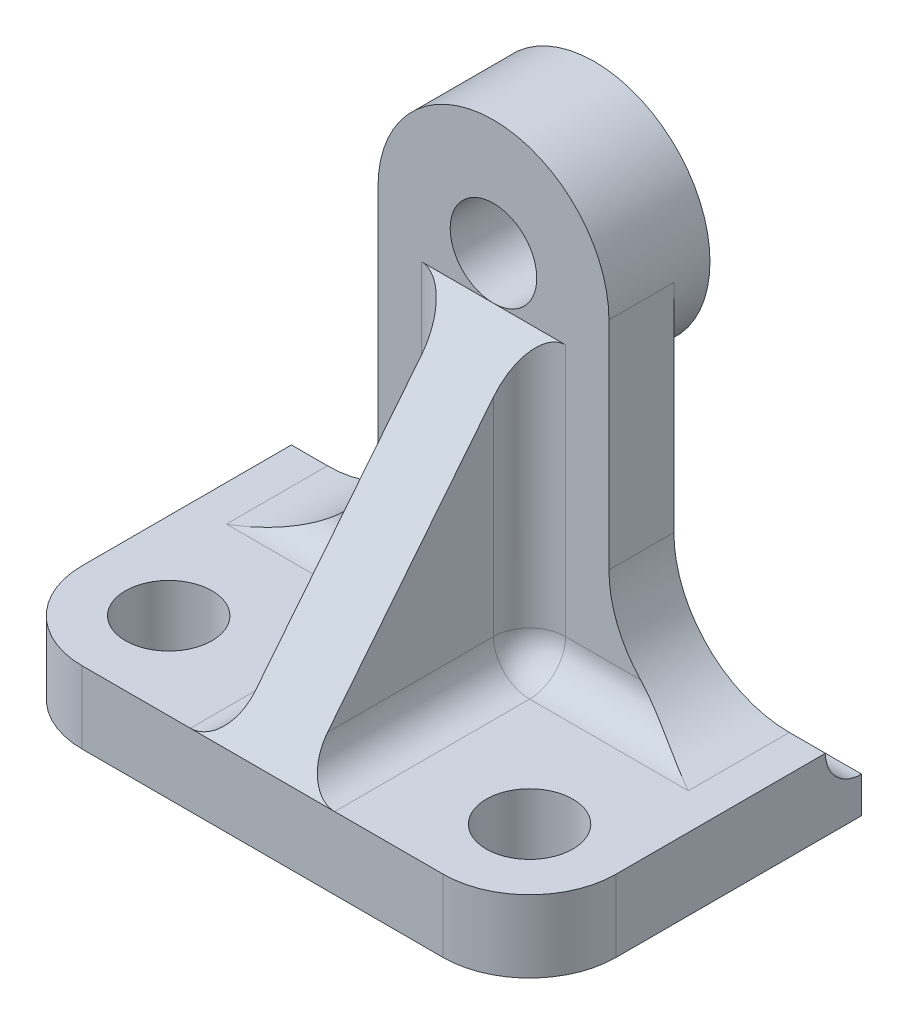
ISO-10303-21;
HEADER;
FILE_DESCRIPTION(('STEP AP214'),'2;1');
FILE_NAME('part.step','',(''),(''),'','','');
FILE_SCHEMA(('AUTOMOTIVE_DESIGN { 1 0 10303 214 1 1 1 1 }'));
ENDSEC;
DATA;
#1=APPLICATION_CONTEXT('core data for automotive mechanical design processes');
#2=APPLICATION_PROTOCOL_DEFINITION('international standard','automotive_design',2000,#1);
#3=PRODUCT_CONTEXT('',#1,'mechanical');
#4=PRODUCT('Part','Part','',(#3));
#5=PRODUCT_RELATED_PRODUCT_CATEGORY('part','',(#4));
#6=PRODUCT_DEFINITION_FORMATION('','',#4);
#7=PRODUCT_DEFINITION_CONTEXT('part definition',#1,'design');
#8=PRODUCT_DEFINITION('design','',#6,#7);
#9=PRODUCT_DEFINITION_SHAPE('','',#8);
#10=(LENGTH_UNIT() NAMED_UNIT(*) SI_UNIT(.MILLI.,.METRE.));
#11=(NAMED_UNIT(*) PLANE_ANGLE_UNIT() SI_UNIT($,.RADIAN.));
#12=(NAMED_UNIT(*) SI_UNIT($,.STERADIAN.) SOLID_ANGLE_UNIT());
#13=UNCERTAINTY_MEASURE_WITH_UNIT(LENGTH_MEASURE(1.E-05),#10,'distance_accuracy_value','');
#14=(GEOMETRIC_REPRESENTATION_CONTEXT(3) GLOBAL_UNCERTAINTY_ASSIGNED_CONTEXT((#13)) GLOBAL_UNIT_ASSIGNED_CONTEXT((#10,
#11,#12)) REPRESENTATION_CONTEXT('',''));
#15=CARTESIAN_POINT('',(0.,0.,0.));
#16=DIRECTION('',(0.,0.,1.));
#17=DIRECTION('',(1.,0.,0.));
#18=AXIS2_PLACEMENT_3D('',#15,#16,#17);
#19=CARTESIAN_POINT('',(-32.7821930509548,0.,46.));
#20=DIRECTION('',(0.,1.,0.));
#21=DIRECTION('',(0.,0.,1.));
#22=AXIS2_PLACEMENT_3D('',#19,#20,#21);
#23=PLANE('',#22);
#24=CARTESIAN_POINT('',(29.217806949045,0.,34.0000000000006));
#25=DIRECTION('',(0.,1.,0.));
#26=DIRECTION('',(0.,0.,1.));
#27=AXIS2_PLACEMENT_3D('',#24,#25,#26);
#28=CIRCLE('',#27,5.99999999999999);
#29=CARTESIAN_POINT('',(29.217806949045,0.,40.0000000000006));
#30=VERTEX_POINT('',#29);
#31=EDGE_CURVE('E401',#30,#30,#28,.T.);
#32=ORIENTED_EDGE('',*,*,#31,.F.);
#33=EDGE_LOOP('',(#32));
#34=FACE_BOUND('',#33,.T.);
#35=DIRECTION('',(1.,0.,0.));
#36=VECTOR('',#35,1.);
#37=CARTESIAN_POINT('',(-32.7821930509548,0.,19.));
#38=LINE('',#37,#36);
#39=CARTESIAN_POINT('',(36.2178069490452,0.,19.0000000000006));
#40=VERTEX_POINT('',#39);
#41=CARTESIAN_POINT('',(14.217806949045,0.,19.));
#42=VERTEX_POINT('',#41);
#43=EDGE_CURVE('E294',#40,#42,#38,.F.);
#44=ORIENTED_EDGE('',*,*,#43,.T.);
#45=DIRECTION('',(0.,0.,1.));
#46=VECTOR('',#45,1.);
#47=CARTESIAN_POINT('',(14.217806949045,0.,46.));
#48=LINE('',#47,#46);
#49=CARTESIAN_POINT('',(14.217806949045,0.,46.));
#50=VERTEX_POINT('',#49);
#51=EDGE_CURVE('E366',#42,#50,#48,.T.);
#52=ORIENTED_EDGE('',*,*,#51,.T.);
#53=DIRECTION('',(1.,0.,0.));
#54=VECTOR('',#53,1.);
#55=CARTESIAN_POINT('',(-32.7821930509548,0.,46.));
#56=LINE('',#55,#54);
#57=CARTESIAN_POINT('',(29.217806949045,0.,46.0000000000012));
#58=VERTEX_POINT('',#57);
#59=EDGE_CURVE('E246',#50,#58,#56,.T.);
#60=ORIENTED_EDGE('',*,*,#59,.T.);
#61=CARTESIAN_POINT('',(29.217806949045,0.,34.0000000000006));
#62=DIRECTION('',(0.,1.,0.));
#63=DIRECTION('',(0.,0.,1.));
#64=AXIS2_PLACEMENT_3D('',#61,#62,#63);
#65=CIRCLE('',#64,12.);
#66=CARTESIAN_POINT('',(41.2178069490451,0.,34.));
#67=VERTEX_POINT('',#66);
#68=EDGE_CURVE('E285',#58,#67,#65,.T.);
#69=ORIENTED_EDGE('',*,*,#68,.T.);
#70=DIRECTION('',(0.,0.,-1.));
#71=VECTOR('',#70,1.);
#72=CARTESIAN_POINT('',(41.2178069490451,0.,46.0000000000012));
#73=LINE('',#72,#71);
#74=CARTESIAN_POINT('',(41.2178069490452,0.,5.));
#75=VERTEX_POINT('',#74);
#76=EDGE_CURVE('E258',#67,#75,#73,.T.);
#77=ORIENTED_EDGE('',*,*,#76,.T.);
#78=DIRECTION('',(1.,0.,0.));
#79=VECTOR('',#78,1.);
#80=CARTESIAN_POINT('',(-142.412252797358,0.,4.99999999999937));
#81=LINE('',#80,#79);
#82=CARTESIAN_POINT('',(36.2178069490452,0.,5.00000000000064));
#83=VERTEX_POINT('',#82);
#84=EDGE_CURVE('E227',#83,#75,#81,.T.);
#85=ORIENTED_EDGE('',*,*,#84,.F.);
#86=DIRECTION('',(0.,0.,-1.));
#87=VECTOR('',#86,1.);
#88=CARTESIAN_POINT('',(36.2178069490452,0.,46.0000000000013));
#89=LINE('',#88,#87);
#90=EDGE_CURVE('E297',#83,#40,#89,.F.);
#91=ORIENTED_EDGE('',*,*,#90,.T.);
#92=EDGE_LOOP('',(#44,#52,#60,#69,#77,#85,#91));
#93=FACE_BOUND('',#92,.T.);
#94=ADVANCED_FACE('F52',(#34,#93),#23,.T.);
#95=CARTESIAN_POINT('',(4.21780694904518,5.,19.0000000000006));
#96=DIRECTION('',(1.,0.,0.));
#97=DIRECTION('',(0.,0.,-1.));
#98=AXIS2_PLACEMENT_3D('',#95,#96,#97);
#99=CYLINDRICAL_SURFACE('',#98,5.);
#100=DIRECTION('',(1.,0.,0.));
#101=VECTOR('',#100,1.);
#102=CARTESIAN_POINT('',(4.21780694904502,5.,14.0000000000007));
#103=LINE('',#102,#101);
#104=CARTESIAN_POINT('',(14.217806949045,5.00000000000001,14.));
#105=VERTEX_POINT('',#104);
#106=CARTESIAN_POINT('',(24.5988569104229,5.,14.));
#107=VERTEX_POINT('',#106);
#108=EDGE_CURVE('E289',#105,#107,#103,.T.);
#109=ORIENTED_EDGE('',*,*,#108,.F.);
#110=CARTESIAN_POINT('',(14.217806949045,5.,19.));
#111=DIRECTION('',(1.,0.,0.));
#112=DIRECTION('',(0.,0.,-1.));
#113=AXIS2_PLACEMENT_3D('',#110,#111,#112);
#114=CIRCLE('',#113,5.);
#115=EDGE_CURVE('E358',#105,#42,#114,.F.);
#116=ORIENTED_EDGE('',*,*,#115,.T.);
#117=ORIENTED_EDGE('',*,*,#43,.F.);
#118=CARTESIAN_POINT('',(24.5988569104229,5.,14.));
#119=CARTESIAN_POINT('',(24.6917310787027,4.90189660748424,14.0000035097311));
#120=CARTESIAN_POINT('',(24.7858292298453,4.80499618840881,14.0028868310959));
#121=CARTESIAN_POINT('',(24.9762624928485,4.61378612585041,14.0140181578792));
#122=CARTESIAN_POINT('',(25.0725969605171,4.5194757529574,14.022264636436));
#123=CARTESIAN_POINT('',(25.3643199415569,4.24100485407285,14.0544153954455));
#124=CARTESIAN_POINT('',(25.562809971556,4.06090145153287,14.0857342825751));
#125=CARTESIAN_POINT('',(25.9646210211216,3.71415493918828,14.1649258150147));
#126=CARTESIAN_POINT('',(26.167878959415,3.54740106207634,14.2126398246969));
#127=CARTESIAN_POINT('',(26.5800240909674,3.22574733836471,14.3222965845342));
#128=CARTESIAN_POINT('',(26.7889148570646,3.07085526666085,14.3842485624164));
#129=CARTESIAN_POINT('',(27.3121584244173,2.70206297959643,14.5527547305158));
#130=CARTESIAN_POINT('',(27.6292471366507,2.49529688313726,14.6664819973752));
#131=CARTESIAN_POINT('',(28.2710641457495,2.10791922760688,14.9148052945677));
#132=CARTESIAN_POINT('',(28.5957945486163,1.92731497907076,15.0494071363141));
#133=CARTESIAN_POINT('',(29.253063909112,1.59064558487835,15.3359250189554));
#134=CARTESIAN_POINT('',(29.5856380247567,1.43473415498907,15.4879400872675));
#135=CARTESIAN_POINT('',(30.2552696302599,1.14803663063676,15.8049956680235));
#136=CARTESIAN_POINT('',(30.5923269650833,1.01724966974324,15.9700357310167));
#137=CARTESIAN_POINT('',(31.3635708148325,0.747251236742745,16.3572357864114));
#138=CARTESIAN_POINT('',(31.7988518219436,0.615704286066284,16.5825744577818));
#139=CARTESIAN_POINT('',(32.6733398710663,0.391007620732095,17.0446953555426));
#140=CARTESIAN_POINT('',(33.1125483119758,0.297872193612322,17.2814818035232));
#141=CARTESIAN_POINT('',(33.9919738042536,0.149323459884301,17.7615045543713));
#142=CARTESIAN_POINT('',(34.4321837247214,0.0937962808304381,18.0047190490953));
#143=CARTESIAN_POINT('',(35.3135552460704,0.0194576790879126,18.4945302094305));
#144=CARTESIAN_POINT('',(35.7547160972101,0.000623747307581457,18.7411247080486));
#145=CARTESIAN_POINT('',(36.2030855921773,5.08166310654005E-06,18.9917705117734));
#146=CARTESIAN_POINT('',(36.2104462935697,2.44707883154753E-09,18.9958852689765));
#147=CARTESIAN_POINT('',(36.2178069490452,0.,19.0000000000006));
#148=B_SPLINE_CURVE_WITH_KNOTS('',3,(#118,#119,#120,#121,#122,#123,#124,#125,#126,#127,#128,
#129,#130,#131,#132,#133,#134,#135,#136,#137,#138,#139,#140,#141,#142,#143,#144,#145,#146,#147),
.UNSPECIFIED.,.F.,.F.,(4,2,2,2,2,2,2,2,2,2,2,2,2,2,4),(0.,0.405180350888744,0.810245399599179,
1.61871587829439,2.41957433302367,3.22095330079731,4.40493796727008,5.58925284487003,
6.78067269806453,7.97205145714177,9.49275211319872,11.0140178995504,12.5306566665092,
14.0463647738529,14.0716629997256),.UNSPECIFIED.);
#149=EDGE_CURVE('E339',#40,#107,#148,.F.);
#150=ORIENTED_EDGE('',*,*,#149,.T.);
#151=EDGE_LOOP('',(#109,#116,#117,#150));
#152=FACE_BOUND('',#151,.T.);
#153=ADVANCED_FACE('F441',(#152),#99,.F.);
#154=CARTESIAN_POINT('',(-32.7821930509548,0.,46.));
#155=DIRECTION('',(1.,0.,0.));
#156=DIRECTION('',(0.,0.,-1.));
#157=AXIS2_PLACEMENT_3D('',#154,#155,#156);
#158=PLANE('',#157);
#159=DIRECTION('',(0.,0.,-1.));
#160=VECTOR('',#159,1.);
#161=CARTESIAN_POINT('',(-32.7821930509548,0.,46.));
#162=LINE('',#161,#160);
#163=CARTESIAN_POINT('',(-32.7821930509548,0.,34.));
#164=VERTEX_POINT('',#163);
#165=CARTESIAN_POINT('',(-32.7821930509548,0.,5.));
#166=VERTEX_POINT('',#165);
#167=EDGE_CURVE('E250',#164,#166,#162,.T.);
#168=ORIENTED_EDGE('',*,*,#167,.T.);
#169=CARTESIAN_POINT('',(-32.7821930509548,0.,0.));
#170=DIRECTION('',(1.,0.,0.));
#171=DIRECTION('',(0.,0.,-1.));
#172=AXIS2_PLACEMENT_3D('',#169,#170,#171);
#173=CIRCLE('',#172,5.);
#174=CARTESIAN_POINT('',(-32.7821930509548,-5.,0.));
#175=VERTEX_POINT('',#174);
#176=EDGE_CURVE('E240',#166,#175,#173,.T.);
#177=ORIENTED_EDGE('',*,*,#176,.T.);
#178=DIRECTION('',(0.,-1.,0.));
#179=VECTOR('',#178,1.);
#180=CARTESIAN_POINT('',(-32.7821930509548,0.,0.));
#181=LINE('',#180,#179);
#182=CARTESIAN_POINT('',(-32.7821930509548,-10.,0.));
#183=VERTEX_POINT('',#182);
#184=EDGE_CURVE('E243',#175,#183,#181,.T.);
#185=ORIENTED_EDGE('',*,*,#184,.T.);
#186=DIRECTION('',(0.,0.,-1.));
#187=VECTOR('',#186,1.);
#188=CARTESIAN_POINT('',(-32.7821930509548,-10.,46.));
#189=LINE('',#188,#187);
#190=CARTESIAN_POINT('',(-32.7821930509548,-10.,34.));
#191=VERTEX_POINT('',#190);
#192=EDGE_CURVE('E264',#191,#183,#189,.T.);
#193=ORIENTED_EDGE('',*,*,#192,.F.);
#194=DIRECTION('',(0.,-1.,0.));
#195=VECTOR('',#194,1.);
#196=CARTESIAN_POINT('',(-32.7821930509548,0.,34.));
#197=LINE('',#196,#195);
#198=EDGE_CURVE('E272',#191,#164,#197,.F.);
#199=ORIENTED_EDGE('',*,*,#198,.T.);
#200=EDGE_LOOP('',(#168,#177,#185,#193,#199));
#201=FACE_BOUND('',#200,.T.);
#202=ADVANCED_FACE('F448',(#201),#158,.F.);
#203=CARTESIAN_POINT('',(-32.7821930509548,-10.,46.));
#204=DIRECTION('',(0.,1.,0.));
#205=DIRECTION('',(0.,0.,1.));
#206=AXIS2_PLACEMENT_3D('',#203,#204,#205);
#207=PLANE('',#206);
#208=CARTESIAN_POINT('',(-20.7821930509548,-9.99999999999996,34.0000000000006));
#209=DIRECTION('',(0.,1.,0.));
#210=DIRECTION('',(0.,0.,1.));
#211=AXIS2_PLACEMENT_3D('',#208,#209,#210);
#212=CIRCLE('',#211,6.);
#213=CARTESIAN_POINT('',(-20.7821930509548,-9.99999999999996,40.0000000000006));
#214=VERTEX_POINT('',#213);
#215=EDGE_CURVE('E384',#214,#214,#212,.T.);
#216=ORIENTED_EDGE('',*,*,#215,.T.);
#217=EDGE_LOOP('',(#216));
#218=FACE_BOUND('',#217,.T.);
#219=CARTESIAN_POINT('',(29.217806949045,-10.,34.0000000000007));
#220=DIRECTION('',(0.,1.,0.));
#221=DIRECTION('',(0.,0.,1.));
#222=AXIS2_PLACEMENT_3D('',#219,#220,#221);
#223=CIRCLE('',#222,5.99999999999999);
#224=CARTESIAN_POINT('',(29.217806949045,-10.,40.0000000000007));
#225=VERTEX_POINT('',#224);
#226=EDGE_CURVE('E396',#225,#225,#223,.T.);
#227=ORIENTED_EDGE('',*,*,#226,.T.);
#228=EDGE_LOOP('',(#227));
#229=FACE_BOUND('',#228,.T.);
#230=DIRECTION('',(1.,0.,0.));
#231=VECTOR('',#230,1.);
#232=CARTESIAN_POINT('',(-32.7821930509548,-10.,0.));
#233=LINE('',#232,#231);
#234=CARTESIAN_POINT('',(41.2178069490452,-10.,6.38378239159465E-13));
#235=VERTEX_POINT('',#234);
#236=EDGE_CURVE('E252',#183,#235,#233,.T.);
#237=ORIENTED_EDGE('',*,*,#236,.T.);
#238=DIRECTION('',(0.,0.,-1.));
#239=VECTOR('',#238,1.);
#240=CARTESIAN_POINT('',(41.2178069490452,-10.,46.0000000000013));
#241=LINE('',#240,#239);
#242=CARTESIAN_POINT('',(41.2178069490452,-9.99999999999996,34.0000000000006));
#243=VERTEX_POINT('',#242);
#244=EDGE_CURVE('E261',#243,#235,#241,.T.);
#245=ORIENTED_EDGE('',*,*,#244,.F.);
#246=CARTESIAN_POINT('',(29.217806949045,-10.,34.0000000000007));
#247=DIRECTION('',(0.,1.,0.));
#248=DIRECTION('',(0.,0.,1.));
#249=AXIS2_PLACEMENT_3D('',#246,#247,#248);
#250=CIRCLE('',#249,12.);
#251=CARTESIAN_POINT('',(29.217806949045,-10.,46.0000000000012));
#252=VERTEX_POINT('',#251);
#253=EDGE_CURVE('E279',#243,#252,#250,.F.);
#254=ORIENTED_EDGE('',*,*,#253,.T.);
#255=DIRECTION('',(1.,0.,0.));
#256=VECTOR('',#255,1.);
#257=CARTESIAN_POINT('',(-32.7821930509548,-10.,46.));
#258=LINE('',#257,#256);
#259=CARTESIAN_POINT('',(-20.7821930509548,-10.,46.0000000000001));
#260=VERTEX_POINT('',#259);
#261=EDGE_CURVE('E244',#260,#252,#258,.T.);
#262=ORIENTED_EDGE('',*,*,#261,.F.);
#263=CARTESIAN_POINT('',(-20.7821930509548,-9.99999999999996,34.0000000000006));
#264=DIRECTION('',(0.,1.,0.));
#265=DIRECTION('',(0.,0.,1.));
#266=AXIS2_PLACEMENT_3D('',#263,#264,#265);
#267=CIRCLE('',#266,12.);
#268=EDGE_CURVE('E270',#260,#191,#267,.F.);
#269=ORIENTED_EDGE('',*,*,#268,.T.);
#270=ORIENTED_EDGE('',*,*,#192,.T.);
#271=EDGE_LOOP('',(#237,#245,#254,#262,#269,#270));
#272=FACE_BOUND('',#271,.T.);
#273=ADVANCED_FACE('F464',(#218,#229,#272),#207,.F.);
#274=CARTESIAN_POINT('',(41.2178069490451,0.,46.0000000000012));
#275=DIRECTION('',(1.,0.,0.));
#276=DIRECTION('',(0.,1.,0.));
#277=AXIS2_PLACEMENT_3D('',#274,#275,#276);
#278=PLANE('',#277);
#279=CARTESIAN_POINT('',(41.2178069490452,0.,0.));
#280=DIRECTION('',(1.,0.,0.));
#281=DIRECTION('',(0.,1.,0.));
#282=AXIS2_PLACEMENT_3D('',#279,#280,#281);
#283=CIRCLE('',#282,5.);
#284=CARTESIAN_POINT('',(41.2178069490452,-5.,6.38378239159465E-13));
#285=VERTEX_POINT('',#284);
#286=EDGE_CURVE('E237',#75,#285,#283,.T.);
#287=ORIENTED_EDGE('',*,*,#286,.F.);
#288=ORIENTED_EDGE('',*,*,#76,.F.);
#289=DIRECTION('',(0.,-1.,0.));
#290=VECTOR('',#289,1.);
#291=CARTESIAN_POINT('',(41.2178069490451,0.,34.));
#292=LINE('',#291,#290);
#293=EDGE_CURVE('E276',#67,#243,#292,.T.);
#294=ORIENTED_EDGE('',*,*,#293,.T.);
#295=ORIENTED_EDGE('',*,*,#244,.T.);
#296=DIRECTION('',(0.,-1.,0.));
#297=VECTOR('',#296,1.);
#298=CARTESIAN_POINT('',(41.2178069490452,0.,0.));
#299=LINE('',#298,#297);
#300=EDGE_CURVE('E247',#285,#235,#299,.T.);
#301=ORIENTED_EDGE('',*,*,#300,.F.);
#302=EDGE_LOOP('',(#287,#288,#294,#295,#301));
#303=FACE_BOUND('',#302,.T.);
#304=ADVANCED_FACE('F456',(#303),#278,.T.);
#305=CARTESIAN_POINT('',(-20.7821930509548,0.,34.0000000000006));
#306=DIRECTION('',(0.,1.,0.));
#307=DIRECTION('',(0.,0.,1.));
#308=AXIS2_PLACEMENT_3D('',#305,#306,#307);
#309=CIRCLE('',#308,6.);
#310=CARTESIAN_POINT('',(-20.7821930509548,0.,40.0000000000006));
#311=VERTEX_POINT('',#310);
#312=EDGE_CURVE('E391',#311,#311,#309,.T.);
#313=ORIENTED_EDGE('',*,*,#312,.F.);
#314=EDGE_LOOP('',(#313));
#315=FACE_BOUND('',#314,.T.);
#316=CARTESIAN_POINT('',(-20.7821930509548,0.,46.0000000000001));
#317=VERTEX_POINT('',#316);
#318=CARTESIAN_POINT('',(-5.78219305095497,0.,46.));
#319=VERTEX_POINT('',#318);
#320=EDGE_CURVE('E248',#317,#319,#56,.T.);
#321=ORIENTED_EDGE('',*,*,#320,.T.);
#322=DIRECTION('',(0.,0.,1.));
#323=VECTOR('',#322,1.);
#324=CARTESIAN_POINT('',(-5.78219305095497,0.,19.));
#325=LINE('',#324,#323);
#326=CARTESIAN_POINT('',(-5.78219305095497,0.,19.));
#327=VERTEX_POINT('',#326);
#328=EDGE_CURVE('E368',#319,#327,#325,.F.);
#329=ORIENTED_EDGE('',*,*,#328,.T.);
#330=CARTESIAN_POINT('',(-27.7821930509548,0.,19.));
#331=VERTEX_POINT('',#330);
#332=EDGE_CURVE('E293',#327,#331,#38,.F.);
#333=ORIENTED_EDGE('',*,*,#332,.T.);
#334=DIRECTION('',(0.,0.,-1.));
#335=VECTOR('',#334,1.);
#336=CARTESIAN_POINT('',(-27.7821930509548,0.,46.));
#337=LINE('',#336,#335);
#338=CARTESIAN_POINT('',(-27.7821930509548,0.,5.));
#339=VERTEX_POINT('',#338);
#340=EDGE_CURVE('E300',#331,#339,#337,.T.);
#341=ORIENTED_EDGE('',*,*,#340,.T.);
#342=EDGE_CURVE('E231',#166,#339,#81,.T.);
#343=ORIENTED_EDGE('',*,*,#342,.F.);
#344=ORIENTED_EDGE('',*,*,#167,.F.);
#345=CARTESIAN_POINT('',(-20.7821930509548,0.,34.0000000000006));
#346=DIRECTION('',(0.,1.,0.));
#347=DIRECTION('',(0.,0.,1.));
#348=AXIS2_PLACEMENT_3D('',#345,#346,#347);
#349=CIRCLE('',#348,12.);
#350=EDGE_CURVE('E274',#164,#317,#349,.T.);
#351=ORIENTED_EDGE('',*,*,#350,.T.);
#352=EDGE_LOOP('',(#321,#329,#333,#341,#343,#344,#351));
#353=FACE_BOUND('',#352,.T.);
#354=ADVANCED_FACE('F444',(#315,#353),#23,.T.);
#355=CARTESIAN_POINT('',(-1.59594559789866E-13,0.,46.));
#356=DIRECTION('',(0.,0.,1.));
#357=DIRECTION('',(1.,0.,0.));
#358=AXIS2_PLACEMENT_3D('',#355,#356,#357);
#359=PLANE('',#358);
#360=ORIENTED_EDGE('',*,*,#261,.T.);
#361=DIRECTION('',(0.,-1.,0.));
#362=VECTOR('',#361,1.);
#363=CARTESIAN_POINT('',(29.217806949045,0.,46.0000000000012));
#364=LINE('',#363,#362);
#365=EDGE_CURVE('E282',#252,#58,#364,.F.);
#366=ORIENTED_EDGE('',*,*,#365,.T.);
#367=ORIENTED_EDGE('',*,*,#59,.F.);
#368=DIRECTION('',(1.,0.,0.));
#369=VECTOR('',#368,1.);
#370=CARTESIAN_POINT('',(-1.59594559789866E-13,0.,46.));
#371=LINE('',#370,#369);
#372=EDGE_CURVE('E69',#50,#319,#371,.F.);
#373=ORIENTED_EDGE('',*,*,#372,.T.);
#374=ORIENTED_EDGE('',*,*,#320,.F.);
#375=DIRECTION('',(0.,-1.,0.));
#376=VECTOR('',#375,1.);
#377=CARTESIAN_POINT('',(-20.7821930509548,-10.,46.0000000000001));
#378=LINE('',#377,#376);
#379=EDGE_CURVE('E267',#317,#260,#378,.T.);
#380=ORIENTED_EDGE('',*,*,#379,.T.);
#381=EDGE_LOOP('',(#360,#366,#367,#373,#374,#380));
#382=FACE_BOUND('',#381,.T.);
#383=ADVANCED_FACE('F455',(#382),#359,.T.);
#384=CARTESIAN_POINT('',(0.,0.,0.));
#385=DIRECTION('',(0.,0.,1.));
#386=DIRECTION('',(1.,0.,0.));
#387=AXIS2_PLACEMENT_3D('',#384,#385,#386);
#388=PLANE('',#387);
#389=DIRECTION('',(1.,0.,0.));
#390=VECTOR('',#389,1.);
#391=CARTESIAN_POINT('',(-142.412252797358,-5.,-6.38378239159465E-13));
#392=LINE('',#391,#390);
#393=EDGE_CURVE('E287',#175,#285,#392,.T.);
#394=ORIENTED_EDGE('',*,*,#393,.T.);
#395=ORIENTED_EDGE('',*,*,#300,.T.);
#396=ORIENTED_EDGE('',*,*,#236,.F.);
#397=ORIENTED_EDGE('',*,*,#184,.F.);
#398=EDGE_LOOP('',(#394,#395,#396,#397));
#399=FACE_BOUND('',#398,.T.);
#400=ADVANCED_FACE('F462',(#399),#388,.F.);
#401=CARTESIAN_POINT('',(-20.7821930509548,0.,34.0000000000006));
#402=DIRECTION('',(0.,1.,0.));
#403=DIRECTION('',(0.,0.,1.));
#404=AXIS2_PLACEMENT_3D('',#401,#402,#403);
#405=CYLINDRICAL_SURFACE('',#404,12.);
#406=ORIENTED_EDGE('',*,*,#350,.F.);
#407=ORIENTED_EDGE('',*,*,#198,.F.);
#408=ORIENTED_EDGE('',*,*,#268,.F.);
#409=ORIENTED_EDGE('',*,*,#379,.F.);
#410=EDGE_LOOP('',(#406,#407,#408,#409));
#411=FACE_BOUND('',#410,.T.);
#412=ADVANCED_FACE('F500',(#411),#405,.T.);
#413=CARTESIAN_POINT('',(29.217806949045,0.,34.0000000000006));
#414=DIRECTION('',(0.,-1.,0.));
#415=DIRECTION('',(1.,0.,0.));
#416=AXIS2_PLACEMENT_3D('',#413,#414,#415);
#417=CYLINDRICAL_SURFACE('',#416,12.);
#418=ORIENTED_EDGE('',*,*,#68,.F.);
#419=ORIENTED_EDGE('',*,*,#365,.F.);
#420=ORIENTED_EDGE('',*,*,#253,.F.);
#421=ORIENTED_EDGE('',*,*,#293,.F.);
#422=EDGE_LOOP('',(#418,#419,#420,#421));
#423=FACE_BOUND('',#422,.T.);
#424=ADVANCED_FACE('F505',(#423),#417,.T.);
#425=CARTESIAN_POINT('',(-142.412252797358,0.,-6.38378239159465E-13));
#426=DIRECTION('',(1.,0.,0.));
#427=DIRECTION('',(0.,0.,-1.));
#428=AXIS2_PLACEMENT_3D('',#425,#426,#427);
#429=CYLINDRICAL_SURFACE('',#428,5.);
#430=EDGE_CURVE('E229',#339,#83,#81,.T.);
#431=ORIENTED_EDGE('',*,*,#430,.T.);
#432=ORIENTED_EDGE('',*,*,#84,.T.);
#433=ORIENTED_EDGE('',*,*,#286,.T.);
#434=ORIENTED_EDGE('',*,*,#393,.F.);
#435=ORIENTED_EDGE('',*,*,#176,.F.);
#436=ORIENTED_EDGE('',*,*,#342,.T.);
#437=EDGE_LOOP('',(#431,#432,#433,#434,#435,#436));
#438=FACE_BOUND('',#437,.T.);
#439=ADVANCED_FACE('F435',(#438),#429,.F.);
#440=CARTESIAN_POINT('',(4.21780694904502,46.0000000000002,14.0000000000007));
#441=DIRECTION('',(0.,0.,-1.));
#442=DIRECTION('',(-1.,0.,0.));
#443=AXIS2_PLACEMENT_3D('',#440,#441,#442);
#444=PLANE('',#443);
#445=DIRECTION('',(-1.,0.,0.));
#446=VECTOR('',#445,1.);
#447=CARTESIAN_POINT('',(4.21780694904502,40.0000000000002,14.0000000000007));
#448=LINE('',#447,#446);
#449=CARTESIAN_POINT('',(4.21780694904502,40.0000000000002,14.0000000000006));
#450=VERTEX_POINT('',#449);
#451=CARTESIAN_POINT('',(14.217806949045,40.0000000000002,14.0000000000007));
#452=VERTEX_POINT('',#451);
#453=EDGE_CURVE('E407',#450,#452,#448,.F.);
#454=ORIENTED_EDGE('',*,*,#453,.T.);
#455=DIRECTION('',(0.,1.,0.));
#456=VECTOR('',#455,1.);
#457=CARTESIAN_POINT('',(14.217806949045,5.00000000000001,14.));
#458=LINE('',#457,#456);
#459=EDGE_CURVE('E356',#452,#105,#458,.F.);
#460=ORIENTED_EDGE('',*,*,#459,.T.);
#461=ORIENTED_EDGE('',*,*,#108,.T.);
#462=CARTESIAN_POINT('',(36.2178069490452,15.9999999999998,14.0000000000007));
#463=DIRECTION('',(0.,0.,-1.));
#464=DIRECTION('',(-1.,0.,0.));
#465=AXIS2_PLACEMENT_3D('',#462,#463,#464);
#466=CIRCLE('',#465,16.);
#467=CARTESIAN_POINT('',(20.2178069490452,16.,14.0000000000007));
#468=VERTEX_POINT('',#467);
#469=EDGE_CURVE('E346',#107,#468,#466,.T.);
#470=ORIENTED_EDGE('',*,*,#469,.T.);
#471=DIRECTION('',(0.,1.,0.));
#472=VECTOR('',#471,1.);
#473=CARTESIAN_POINT('',(20.2178069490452,0.,14.));
#474=LINE('',#473,#472);
#475=CARTESIAN_POINT('',(20.2178069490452,46.0000000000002,14.));
#476=VERTEX_POINT('',#475);
#477=EDGE_CURVE('E232',#468,#476,#474,.T.);
#478=ORIENTED_EDGE('',*,*,#477,.T.);
#479=CARTESIAN_POINT('',(4.21780694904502,46.0000000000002,14.0000000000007));
#480=DIRECTION('',(0.,0.,1.));
#481=DIRECTION('',(-1.,0.,0.));
#482=AXIS2_PLACEMENT_3D('',#479,#480,#481);
#483=CIRCLE('',#482,16.);
#484=CARTESIAN_POINT('',(-11.782193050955,46.0000000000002,14.));
#485=VERTEX_POINT('',#484);
#486=EDGE_CURVE('E419',#476,#485,#483,.T.);
#487=ORIENTED_EDGE('',*,*,#486,.T.);
#488=DIRECTION('',(0.,-1.,0.));
#489=VECTOR('',#488,1.);
#490=CARTESIAN_POINT('',(-11.782193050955,0.,14.));
#491=LINE('',#490,#489);
#492=CARTESIAN_POINT('',(-11.782193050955,16.,14.0000000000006));
#493=VERTEX_POINT('',#492);
#494=EDGE_CURVE('E225',#485,#493,#491,.T.);
#495=ORIENTED_EDGE('',*,*,#494,.T.);
#496=CARTESIAN_POINT('',(-27.7821930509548,16.,14.0000000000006));
#497=DIRECTION('',(0.,0.,-1.));
#498=DIRECTION('',(-1.,0.,0.));
#499=AXIS2_PLACEMENT_3D('',#496,#497,#498);
#500=CIRCLE('',#499,16.);
#501=CARTESIAN_POINT('',(-16.1632430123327,5.,14.));
#502=VERTEX_POINT('',#501);
#503=EDGE_CURVE('E309',#493,#502,#500,.T.);
#504=ORIENTED_EDGE('',*,*,#503,.T.);
#505=CARTESIAN_POINT('',(-5.78219305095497,5.,14.));
#506=VERTEX_POINT('',#505);
#507=EDGE_CURVE('E290',#502,#506,#103,.T.);
#508=ORIENTED_EDGE('',*,*,#507,.T.);
#509=DIRECTION('',(0.,1.,0.));
#510=VECTOR('',#509,1.);
#511=CARTESIAN_POINT('',(-5.78219305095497,46.0000000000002,14.));
#512=LINE('',#511,#510);
#513=CARTESIAN_POINT('',(-5.78219305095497,40.0000000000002,14.));
#514=VERTEX_POINT('',#513);
#515=EDGE_CURVE('E353',#506,#514,#512,.T.);
#516=ORIENTED_EDGE('',*,*,#515,.T.);
#517=EDGE_CURVE('E411',#514,#450,#448,.F.);
#518=ORIENTED_EDGE('',*,*,#517,.T.);
#519=CARTESIAN_POINT('',(4.21780694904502,46.0000000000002,14.0000000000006));
#520=DIRECTION('',(0.,0.,-1.));
#521=DIRECTION('',(-1.,0.,0.));
#522=AXIS2_PLACEMENT_3D('',#519,#520,#521);
#523=CIRCLE('',#522,6.);
#524=EDGE_CURVE('E221',#450,#450,#523,.T.);
#525=ORIENTED_EDGE('',*,*,#524,.T.);
#526=EDGE_LOOP('',(#454,#460,#461,#470,#478,#487,#495,#504,#508,#516,#518,#525));
#527=FACE_BOUND('',#526,.T.);
#528=ADVANCED_FACE('F427',(#527),#444,.F.);
#529=CARTESIAN_POINT('',(4.21780694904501,46.0000000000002,6.38378239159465E-13));
#530=DIRECTION('',(0.,0.,-1.));
#531=DIRECTION('',(-1.,0.,0.));
#532=AXIS2_PLACEMENT_3D('',#529,#530,#531);
#533=PLANE('',#532);
#534=CARTESIAN_POINT('',(4.21780694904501,46.0000000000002,6.38378239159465E-13));
#535=DIRECTION('',(0.,0.,-1.));
#536=DIRECTION('',(-1.,0.,0.));
#537=AXIS2_PLACEMENT_3D('',#534,#535,#536);
#538=CIRCLE('',#537,6.);
#539=CARTESIAN_POINT('',(-1.78219305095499,46.0000000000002,6.38378239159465E-13));
#540=VERTEX_POINT('',#539);
#541=EDGE_CURVE('E413',#540,#540,#538,.T.);
#542=ORIENTED_EDGE('',*,*,#541,.F.);
#543=EDGE_LOOP('',(#542));
#544=FACE_BOUND('',#543,.T.);
#545=CARTESIAN_POINT('',(4.21780694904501,46.0000000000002,6.38378239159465E-13));
#546=DIRECTION('',(0.,0.,1.));
#547=DIRECTION('',(-1.,0.,0.));
#548=AXIS2_PLACEMENT_3D('',#545,#546,#547);
#549=CIRCLE('',#548,16.);
#550=CARTESIAN_POINT('',(-11.782193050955,46.0000000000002,6.38378239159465E-13));
#551=VERTEX_POINT('',#550);
#552=EDGE_CURVE('E209',#551,#551,#549,.T.);
#553=ORIENTED_EDGE('',*,*,#552,.F.);
#554=EDGE_LOOP('',(#553));
#555=FACE_BOUND('',#554,.T.);
#556=ADVANCED_FACE('F425',(#544,#555),#533,.T.);
#557=CARTESIAN_POINT('',(4.21780694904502,46.0000000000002,14.0000000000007));
#558=DIRECTION('',(0.,0.,-1.));
#559=DIRECTION('',(-1.,0.,0.));
#560=AXIS2_PLACEMENT_3D('',#557,#558,#559);
#561=CYLINDRICAL_SURFACE('',#560,16.);
#562=DIRECTION('',(0.,0.,-1.));
#563=VECTOR('',#562,1.);
#564=CARTESIAN_POINT('',(20.2178069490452,46.0000000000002,14.));
#565=LINE('',#564,#563);
#566=CARTESIAN_POINT('',(20.2178069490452,46.,5.));
#567=VERTEX_POINT('',#566);
#568=EDGE_CURVE('E220',#476,#567,#565,.T.);
#569=ORIENTED_EDGE('',*,*,#568,.T.);
#570=CARTESIAN_POINT('',(4.21780694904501,46.,5.00000000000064));
#571=DIRECTION('',(0.,0.,1.));
#572=DIRECTION('',(1.,0.,0.));
#573=AXIS2_PLACEMENT_3D('',#570,#571,#572);
#574=CIRCLE('',#573,16.);
#575=CARTESIAN_POINT('',(-11.7821930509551,46.,5.));
#576=VERTEX_POINT('',#575);
#577=EDGE_CURVE('E202',#576,#567,#574,.T.);
#578=ORIENTED_EDGE('',*,*,#577,.F.);
#579=DIRECTION('',(0.,0.,-1.));
#580=VECTOR('',#579,1.);
#581=CARTESIAN_POINT('',(-11.782193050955,46.0000000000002,14.));
#582=LINE('',#581,#580);
#583=EDGE_CURVE('E218',#485,#576,#582,.T.);
#584=ORIENTED_EDGE('',*,*,#583,.F.);
#585=ORIENTED_EDGE('',*,*,#486,.F.);
#586=EDGE_LOOP('',(#569,#578,#584,#585));
#587=FACE_BOUND('',#586,.T.);
#588=ORIENTED_EDGE('',*,*,#552,.T.);
#589=EDGE_LOOP('',(#588));
#590=FACE_BOUND('',#589,.T.);
#591=ADVANCED_FACE('F215',(#587,#590),#561,.T.);
#592=CARTESIAN_POINT('',(-11.782193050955,0.,14.));
#593=DIRECTION('',(1.,0.,0.));
#594=DIRECTION('',(0.,0.,-1.));
#595=AXIS2_PLACEMENT_3D('',#592,#593,#594);
#596=PLANE('',#595);
#597=DIRECTION('',(0.,1.,0.));
#598=VECTOR('',#597,1.);
#599=CARTESIAN_POINT('',(-11.7821930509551,46.,5.));
#600=LINE('',#599,#598);
#601=CARTESIAN_POINT('',(-11.7821930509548,16.,5.00000000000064));
#602=VERTEX_POINT('',#601);
#603=EDGE_CURVE('E198',#602,#576,#600,.T.);
#604=ORIENTED_EDGE('',*,*,#603,.F.);
#605=DIRECTION('',(0.,0.,-1.));
#606=VECTOR('',#605,1.);
#607=CARTESIAN_POINT('',(-11.782193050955,16.,14.0000000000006));
#608=LINE('',#607,#606);
#609=EDGE_CURVE('E303',#602,#493,#608,.F.);
#610=ORIENTED_EDGE('',*,*,#609,.T.);
#611=ORIENTED_EDGE('',*,*,#494,.F.);
#612=ORIENTED_EDGE('',*,*,#583,.T.);
#613=EDGE_LOOP('',(#604,#610,#611,#612));
#614=FACE_BOUND('',#613,.T.);
#615=ADVANCED_FACE('F223',(#614),#596,.F.);
#616=CARTESIAN_POINT('',(20.2178069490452,0.,14.));
#617=DIRECTION('',(-1.,0.,0.));
#618=DIRECTION('',(0.,0.,1.));
#619=AXIS2_PLACEMENT_3D('',#616,#617,#618);
#620=PLANE('',#619);
#621=ORIENTED_EDGE('',*,*,#477,.F.);
#622=DIRECTION('',(0.,0.,-1.));
#623=VECTOR('',#622,1.);
#624=CARTESIAN_POINT('',(20.2178069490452,16.,14.0000000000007));
#625=LINE('',#624,#623);
#626=CARTESIAN_POINT('',(20.217806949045,16.,5.00000000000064));
#627=VERTEX_POINT('',#626);
#628=EDGE_CURVE('E305',#468,#627,#625,.T.);
#629=ORIENTED_EDGE('',*,*,#628,.T.);
#630=DIRECTION('',(0.,-1.,0.));
#631=VECTOR('',#630,1.);
#632=CARTESIAN_POINT('',(20.2178069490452,46.,5.));
#633=LINE('',#632,#631);
#634=EDGE_CURVE('E210',#567,#627,#633,.T.);
#635=ORIENTED_EDGE('',*,*,#634,.F.);
#636=ORIENTED_EDGE('',*,*,#568,.F.);
#637=EDGE_LOOP('',(#621,#629,#635,#636));
#638=FACE_BOUND('',#637,.T.);
#639=ADVANCED_FACE('F535',(#638),#620,.F.);
#640=CARTESIAN_POINT('',(41.2188069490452,46.,5.00000000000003));
#641=DIRECTION('',(0.,0.,1.));
#642=DIRECTION('',(1.,0.,0.));
#643=AXIS2_PLACEMENT_3D('',#640,#641,#642);
#644=PLANE('',#643);
#645=ORIENTED_EDGE('',*,*,#577,.T.);
#646=ORIENTED_EDGE('',*,*,#634,.T.);
#647=CARTESIAN_POINT('',(36.2178069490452,16.,5.00000000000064));
#648=DIRECTION('',(0.,0.,1.));
#649=DIRECTION('',(1.,0.,0.));
#650=AXIS2_PLACEMENT_3D('',#647,#648,#649);
#651=CIRCLE('',#650,16.);
#652=EDGE_CURVE('E321',#627,#83,#651,.T.);
#653=ORIENTED_EDGE('',*,*,#652,.T.);
#654=ORIENTED_EDGE('',*,*,#430,.F.);
#655=CARTESIAN_POINT('',(-27.7821930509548,16.,5.00000000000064));
#656=DIRECTION('',(0.,0.,1.));
#657=DIRECTION('',(1.,0.,0.));
#658=AXIS2_PLACEMENT_3D('',#655,#656,#657);
#659=CIRCLE('',#658,16.);
#660=EDGE_CURVE('E205',#339,#602,#659,.T.);
#661=ORIENTED_EDGE('',*,*,#660,.T.);
#662=ORIENTED_EDGE('',*,*,#603,.T.);
#663=EDGE_LOOP('',(#645,#646,#653,#654,#661,#662));
#664=FACE_BOUND('',#663,.T.);
#665=ADVANCED_FACE('F200',(#664),#644,.F.);
#666=ORIENTED_EDGE('',*,*,#332,.F.);
#667=CARTESIAN_POINT('',(-5.78219305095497,5.,19.));
#668=DIRECTION('',(1.,0.,0.));
#669=DIRECTION('',(0.,0.,-1.));
#670=AXIS2_PLACEMENT_3D('',#667,#668,#669);
#671=CIRCLE('',#670,5.);
#672=EDGE_CURVE('E364',#327,#506,#671,.T.);
#673=ORIENTED_EDGE('',*,*,#672,.T.);
#674=ORIENTED_EDGE('',*,*,#507,.F.);
#675=CARTESIAN_POINT('',(-16.1632430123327,5.,14.));
#676=CARTESIAN_POINT('',(-16.2561171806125,4.90189660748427,14.0000035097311));
#677=CARTESIAN_POINT('',(-16.3502153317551,4.80499618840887,14.0028868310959));
#678=CARTESIAN_POINT('',(-16.5406485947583,4.61378612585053,14.0140181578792));
#679=CARTESIAN_POINT('',(-16.6369830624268,4.51947575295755,14.022264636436));
#680=CARTESIAN_POINT('',(-16.9287060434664,4.24100485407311,14.0544153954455));
#681=CARTESIAN_POINT('',(-17.1271960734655,4.06090145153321,14.0857342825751));
#682=CARTESIAN_POINT('',(-17.5290071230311,3.71415493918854,14.1649258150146));
#683=CARTESIAN_POINT('',(-17.7322650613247,3.54740106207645,14.2126398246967));
#684=CARTESIAN_POINT('',(-18.1444101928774,3.22574733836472,14.3222965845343));
#685=CARTESIAN_POINT('',(-18.3533009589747,3.07085526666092,14.3842485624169));
#686=CARTESIAN_POINT('',(-18.8765445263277,2.70206297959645,14.5527547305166));
#687=CARTESIAN_POINT('',(-19.1936332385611,2.49529688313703,14.6664819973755));
#688=CARTESIAN_POINT('',(-19.83545024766,2.10791922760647,14.9148052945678));
#689=CARTESIAN_POINT('',(-20.1601806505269,1.92731497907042,15.0494071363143));
#690=CARTESIAN_POINT('',(-20.8174500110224,1.59064558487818,15.3359250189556));
#691=CARTESIAN_POINT('',(-21.1500241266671,1.43473415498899,15.4879400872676));
#692=CARTESIAN_POINT('',(-21.8196557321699,1.14803663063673,15.8049956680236));
#693=CARTESIAN_POINT('',(-22.1567130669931,1.01724966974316,15.9700357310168));
#694=CARTESIAN_POINT('',(-22.9279569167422,0.747251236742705,16.3572357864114));
#695=CARTESIAN_POINT('',(-23.3632379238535,0.615704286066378,16.5825744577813));
#696=CARTESIAN_POINT('',(-24.2377259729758,0.3910076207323,17.0446953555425));
#697=CARTESIAN_POINT('',(-24.6769344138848,0.297872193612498,17.2814818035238));
#698=CARTESIAN_POINT('',(-25.5563599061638,0.14932345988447,17.7615045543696));
#699=CARTESIAN_POINT('',(-25.9965698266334,0.0937962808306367,18.0047190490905));
#700=CARTESIAN_POINT('',(-26.8779413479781,0.0194576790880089,18.4945302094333));
#701=CARTESIAN_POINT('',(-27.3191021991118,0.000623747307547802,18.7411247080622));
#702=CARTESIAN_POINT('',(-27.7674716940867,5.08166310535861E-06,18.9917705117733));
#703=CARTESIAN_POINT('',(-27.7748323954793,2.44707822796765E-09,18.9958852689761));
#704=CARTESIAN_POINT('',(-27.7821930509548,0.,19.));
#705=B_SPLINE_CURVE_WITH_KNOTS('',3,(#675,#676,#677,#678,#679,#680,#681,#682,#683,#684,#685,
#686,#687,#688,#689,#690,#691,#692,#693,#694,#695,#696,#697,#698,#699,#700,#701,#702,#703,#704),
.UNSPECIFIED.,.F.,.F.,(4,2,2,2,2,2,2,2,2,2,2,2,2,2,4),(0.,0.405180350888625,0.810245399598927,
1.61871587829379,2.41957433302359,3.2209533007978,4.40493796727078,5.58925284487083,
6.78067269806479,7.97205145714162,9.49275211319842,11.0140178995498,12.5306566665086,
14.0463647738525,14.071662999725),.UNSPECIFIED.);
#706=EDGE_CURVE('E312',#502,#331,#705,.T.);
#707=ORIENTED_EDGE('',*,*,#706,.T.);
#708=EDGE_LOOP('',(#666,#673,#674,#707));
#709=FACE_BOUND('',#708,.T.);
#710=ADVANCED_FACE('F323',(#709),#99,.F.);
#711=CARTESIAN_POINT('',(-27.7821930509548,16.,46.0000000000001));
#712=DIRECTION('',(0.,0.,-1.));
#713=DIRECTION('',(-1.,0.,0.));
#714=AXIS2_PLACEMENT_3D('',#711,#712,#713);
#715=CYLINDRICAL_SURFACE('',#714,16.);
#716=ORIENTED_EDGE('',*,*,#503,.F.);
#717=ORIENTED_EDGE('',*,*,#609,.F.);
#718=ORIENTED_EDGE('',*,*,#660,.F.);
#719=ORIENTED_EDGE('',*,*,#340,.F.);
#720=ORIENTED_EDGE('',*,*,#706,.F.);
#721=EDGE_LOOP('',(#716,#717,#718,#719,#720));
#722=FACE_BOUND('',#721,.T.);
#723=ADVANCED_FACE('F326',(#722),#715,.F.);
#724=CARTESIAN_POINT('',(36.2178069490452,15.9999999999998,14.0000000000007));
#725=DIRECTION('',(0.,0.,-1.));
#726=DIRECTION('',(-1.,0.,0.));
#727=AXIS2_PLACEMENT_3D('',#724,#725,#726);
#728=CYLINDRICAL_SURFACE('',#727,16.);
#729=ORIENTED_EDGE('',*,*,#149,.F.);
#730=ORIENTED_EDGE('',*,*,#90,.F.);
#731=ORIENTED_EDGE('',*,*,#652,.F.);
#732=ORIENTED_EDGE('',*,*,#628,.F.);
#733=ORIENTED_EDGE('',*,*,#469,.F.);
#734=EDGE_LOOP('',(#729,#730,#731,#732,#733));
#735=FACE_BOUND('',#734,.T.);
#736=ADVANCED_FACE('F330',(#735),#728,.F.);
#737=CARTESIAN_POINT('',(4.21780694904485,46.0000000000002,46.0000000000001));
#738=DIRECTION('',(0.,0.,-1.));
#739=DIRECTION('',(-1.,0.,0.));
#740=AXIS2_PLACEMENT_3D('',#737,#738,#739);
#741=CYLINDRICAL_SURFACE('',#740,6.);
#742=ORIENTED_EDGE('',*,*,#524,.F.);
#743=EDGE_LOOP('',(#742));
#744=FACE_BOUND('',#743,.T.);
#745=ORIENTED_EDGE('',*,*,#541,.T.);
#746=EDGE_LOOP('',(#745));
#747=FACE_BOUND('',#746,.T.);
#748=ADVANCED_FACE('F335',(#744,#747),#741,.F.);
#749=CARTESIAN_POINT('',(4.21780694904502,40.0000000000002,14.0000000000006));
#750=DIRECTION('',(0.,-0.624695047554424,-0.78086880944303));
#751=DIRECTION('',(0.,-0.78086880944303,0.624695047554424));
#752=AXIS2_PLACEMENT_3D('',#749,#750,#751);
#753=PLANE('',#752);
#754=ORIENTED_EDGE('',*,*,#372,.F.);
#755=CARTESIAN_POINT('',(14.217806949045,5.,42.));
#756=DIRECTION('',(0.,-0.624695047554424,-0.78086880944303));
#757=DIRECTION('',(0.,-0.78086880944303,0.624695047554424));
#758=AXIS2_PLACEMENT_3D('',#755,#756,#757);
#759=ELLIPSE('',#758,6.40312423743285,5.);
#760=CARTESIAN_POINT('',(9.21780694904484,4.99999999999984,42.));
#761=VERTEX_POINT('',#760);
#762=EDGE_CURVE('E61',#50,#761,#759,.T.);
#763=ORIENTED_EDGE('',*,*,#762,.T.);
#764=DIRECTION('',(0.,-0.78086880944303,0.624695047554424));
#765=VECTOR('',#764,1.);
#766=CARTESIAN_POINT('',(9.217806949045,40.0000000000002,14.0000000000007));
#767=LINE('',#766,#765);
#768=CARTESIAN_POINT('',(9.217806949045,33.7500000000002,19.0000000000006));
#769=VERTEX_POINT('',#768);
#770=EDGE_CURVE('E381',#769,#761,#767,.T.);
#771=ORIENTED_EDGE('',*,*,#770,.F.);
#772=CARTESIAN_POINT('',(14.217806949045,33.7500000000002,19.0000000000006));
#773=DIRECTION('',(0.,-0.624695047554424,-0.78086880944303));
#774=DIRECTION('',(0.,-0.78086880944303,0.624695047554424));
#775=AXIS2_PLACEMENT_3D('',#772,#773,#774);
#776=ELLIPSE('',#775,8.00390529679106,5.);
#777=EDGE_CURVE('E370',#769,#452,#776,.T.);
#778=ORIENTED_EDGE('',*,*,#777,.T.);
#779=ORIENTED_EDGE('',*,*,#453,.F.);
#780=ORIENTED_EDGE('',*,*,#517,.F.);
#781=CARTESIAN_POINT('',(-5.78219305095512,33.7500000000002,19.));
#782=DIRECTION('',(0.,-0.624695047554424,-0.78086880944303));
#783=DIRECTION('',(0.,0.78086880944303,-0.624695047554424));
#784=AXIS2_PLACEMENT_3D('',#781,#782,#783);
#785=ELLIPSE('',#784,8.00390529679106,5.);
#786=CARTESIAN_POINT('',(-0.782193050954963,33.7500000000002,19.));
#787=VERTEX_POINT('',#786);
#788=EDGE_CURVE('E373',#514,#787,#785,.T.);
#789=ORIENTED_EDGE('',*,*,#788,.T.);
#790=DIRECTION('',(0.,-0.78086880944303,0.624695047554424));
#791=VECTOR('',#790,1.);
#792=CARTESIAN_POINT('',(-0.782193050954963,40.0000000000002,14.));
#793=LINE('',#792,#791);
#794=CARTESIAN_POINT('',(-0.782193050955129,5.,42.));
#795=VERTEX_POINT('',#794);
#796=EDGE_CURVE('E404',#787,#795,#793,.T.);
#797=ORIENTED_EDGE('',*,*,#796,.T.);
#798=CARTESIAN_POINT('',(-5.78219305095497,5.,42.));
#799=DIRECTION('',(0.,-0.624695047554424,-0.78086880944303));
#800=DIRECTION('',(0.,0.78086880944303,-0.624695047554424));
#801=AXIS2_PLACEMENT_3D('',#798,#799,#800);
#802=ELLIPSE('',#801,6.40312423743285,5.);
#803=EDGE_CURVE('E13',#795,#319,#802,.T.);
#804=ORIENTED_EDGE('',*,*,#803,.T.);
#805=EDGE_LOOP('',(#754,#763,#771,#778,#779,#780,#789,#797,#804));
#806=FACE_BOUND('',#805,.T.);
#807=ADVANCED_FACE('F474',(#806),#753,.F.);
#808=CARTESIAN_POINT('',(-0.78219305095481,26.0000000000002,23.));
#809=DIRECTION('',(-1.,0.,0.));
#810=DIRECTION('',(0.,0.,1.));
#811=AXIS2_PLACEMENT_3D('',#808,#809,#810);
#812=PLANE('',#811);
#813=ORIENTED_EDGE('',*,*,#796,.F.);
#814=DIRECTION('',(0.,1.,0.));
#815=VECTOR('',#814,1.);
#816=CARTESIAN_POINT('',(-0.782193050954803,26.,19.));
#817=LINE('',#816,#815);
#818=CARTESIAN_POINT('',(-0.782193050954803,5.,19.));
#819=VERTEX_POINT('',#818);
#820=EDGE_CURVE('E362',#787,#819,#817,.F.);
#821=ORIENTED_EDGE('',*,*,#820,.T.);
#822=DIRECTION('',(0.,0.,1.));
#823=VECTOR('',#822,1.);
#824=CARTESIAN_POINT('',(-0.78219305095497,5.,46.));
#825=LINE('',#824,#823);
#826=EDGE_CURVE('E360',#819,#795,#825,.T.);
#827=ORIENTED_EDGE('',*,*,#826,.T.);
#828=EDGE_LOOP('',(#813,#821,#827));
#829=FACE_BOUND('',#828,.T.);
#830=ADVANCED_FACE('F530',(#829),#812,.T.);
#831=CARTESIAN_POINT('',(9.21780694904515,26.0000000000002,23.0000000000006));
#832=DIRECTION('',(-1.,0.,0.));
#833=DIRECTION('',(0.,0.,1.));
#834=AXIS2_PLACEMENT_3D('',#831,#832,#833);
#835=PLANE('',#834);
#836=DIRECTION('',(0.,0.,1.));
#837=VECTOR('',#836,1.);
#838=CARTESIAN_POINT('',(9.21780694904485,4.99999999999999,23.));
#839=LINE('',#838,#837);
#840=CARTESIAN_POINT('',(9.21780694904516,4.99999999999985,19.));
#841=VERTEX_POINT('',#840);
#842=EDGE_CURVE('E348',#761,#841,#839,.F.);
#843=ORIENTED_EDGE('',*,*,#842,.T.);
#844=DIRECTION('',(0.,1.,0.));
#845=VECTOR('',#844,1.);
#846=CARTESIAN_POINT('',(9.217806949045,40.0000000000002,19.0000000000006));
#847=LINE('',#846,#845);
#848=EDGE_CURVE('E350',#841,#769,#847,.T.);
#849=ORIENTED_EDGE('',*,*,#848,.T.);
#850=ORIENTED_EDGE('',*,*,#770,.T.);
#851=EDGE_LOOP('',(#843,#849,#850));
#852=FACE_BOUND('',#851,.T.);
#853=ADVANCED_FACE('F514',(#852),#835,.F.);
#854=CARTESIAN_POINT('',(14.217806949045,5.00000000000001,46.));
#855=DIRECTION('',(0.,0.,1.));
#856=DIRECTION('',(1.,0.,0.));
#857=AXIS2_PLACEMENT_3D('',#854,#855,#856);
#858=CYLINDRICAL_SURFACE('',#857,5.);
#859=ORIENTED_EDGE('',*,*,#762,.F.);
#860=ORIENTED_EDGE('',*,*,#51,.F.);
#861=CARTESIAN_POINT('',(14.217806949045,5.,19.));
#862=DIRECTION('',(0.,0.,1.));
#863=DIRECTION('',(1.,0.,0.));
#864=AXIS2_PLACEMENT_3D('',#861,#862,#863);
#865=CIRCLE('',#864,5.);
#866=EDGE_CURVE('E379',#841,#42,#865,.T.);
#867=ORIENTED_EDGE('',*,*,#866,.F.);
#868=ORIENTED_EDGE('',*,*,#842,.F.);
#869=EDGE_LOOP('',(#859,#860,#867,#868));
#870=FACE_BOUND('',#869,.T.);
#871=ADVANCED_FACE('F510',(#870),#858,.F.);
#872=CARTESIAN_POINT('',(14.217806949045,5.,19.));
#873=DIRECTION('',(-1.,0.,0.));
#874=DIRECTION('',(0.,0.,1.));
#875=AXIS2_PLACEMENT_3D('',#872,#873,#874);
#876=SPHERICAL_SURFACE('',#875,5.);
#877=ORIENTED_EDGE('',*,*,#866,.T.);
#878=ORIENTED_EDGE('',*,*,#115,.F.);
#879=CARTESIAN_POINT('',(14.217806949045,5.,19.));
#880=DIRECTION('',(0.,-1.,0.));
#881=DIRECTION('',(0.,0.,-1.));
#882=AXIS2_PLACEMENT_3D('',#879,#880,#881);
#883=CIRCLE('',#882,5.);
#884=EDGE_CURVE('E376',#841,#105,#883,.T.);
#885=ORIENTED_EDGE('',*,*,#884,.F.);
#886=EDGE_LOOP('',(#877,#878,#885));
#887=FACE_BOUND('',#886,.T.);
#888=ADVANCED_FACE('F583',(#887),#876,.F.);
#889=CARTESIAN_POINT('',(14.217806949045,26.,19.0000000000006));
#890=DIRECTION('',(0.,-1.,0.));
#891=DIRECTION('',(0.,0.,-1.));
#892=AXIS2_PLACEMENT_3D('',#889,#890,#891);
#893=CYLINDRICAL_SURFACE('',#892,5.);
#894=ORIENTED_EDGE('',*,*,#884,.T.);
#895=ORIENTED_EDGE('',*,*,#459,.F.);
#896=ORIENTED_EDGE('',*,*,#777,.F.);
#897=ORIENTED_EDGE('',*,*,#848,.F.);
#898=EDGE_LOOP('',(#894,#895,#896,#897));
#899=FACE_BOUND('',#898,.T.);
#900=ADVANCED_FACE('F337',(#899),#893,.F.);
#901=CARTESIAN_POINT('',(-5.78219305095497,5.,23.));
#902=DIRECTION('',(0.,0.,-1.));
#903=DIRECTION('',(-1.,0.,0.));
#904=AXIS2_PLACEMENT_3D('',#901,#902,#903);
#905=CYLINDRICAL_SURFACE('',#904,5.);
#906=CARTESIAN_POINT('',(-5.78219305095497,5.,19.));
#907=DIRECTION('',(0.,0.,1.));
#908=DIRECTION('',(1.,0.,0.));
#909=AXIS2_PLACEMENT_3D('',#906,#907,#908);
#910=CIRCLE('',#909,5.);
#911=EDGE_CURVE('E56',#327,#819,#910,.T.);
#912=ORIENTED_EDGE('',*,*,#911,.F.);
#913=ORIENTED_EDGE('',*,*,#328,.F.);
#914=ORIENTED_EDGE('',*,*,#803,.F.);
#915=ORIENTED_EDGE('',*,*,#826,.F.);
#916=EDGE_LOOP('',(#912,#913,#914,#915));
#917=FACE_BOUND('',#916,.T.);
#918=ADVANCED_FACE('F54',(#917),#905,.F.);
#919=CARTESIAN_POINT('',(-5.78219305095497,5.,19.));
#920=DIRECTION('',(-1.,0.,0.));
#921=DIRECTION('',(0.,0.,1.));
#922=AXIS2_PLACEMENT_3D('',#919,#920,#921);
#923=SPHERICAL_SURFACE('',#922,5.);
#924=ORIENTED_EDGE('',*,*,#672,.F.);
#925=ORIENTED_EDGE('',*,*,#911,.T.);
#926=CARTESIAN_POINT('',(-5.78219305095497,5.,19.));
#927=DIRECTION('',(0.,-1.,0.));
#928=DIRECTION('',(0.,0.,-1.));
#929=AXIS2_PLACEMENT_3D('',#926,#927,#928);
#930=CIRCLE('',#929,5.);
#931=EDGE_CURVE('E382',#506,#819,#930,.T.);
#932=ORIENTED_EDGE('',*,*,#931,.F.);
#933=EDGE_LOOP('',(#924,#925,#932));
#934=FACE_BOUND('',#933,.T.);
#935=ADVANCED_FACE('F481',(#934),#923,.F.);
#936=CARTESIAN_POINT('',(-5.78219305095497,46.0000000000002,19.));
#937=DIRECTION('',(0.,1.,0.));
#938=DIRECTION('',(0.,0.,1.));
#939=AXIS2_PLACEMENT_3D('',#936,#937,#938);
#940=CYLINDRICAL_SURFACE('',#939,5.);
#941=ORIENTED_EDGE('',*,*,#931,.T.);
#942=ORIENTED_EDGE('',*,*,#820,.F.);
#943=ORIENTED_EDGE('',*,*,#788,.F.);
#944=ORIENTED_EDGE('',*,*,#515,.F.);
#945=EDGE_LOOP('',(#941,#942,#943,#944));
#946=FACE_BOUND('',#945,.T.);
#947=ADVANCED_FACE('F573',(#946),#940,.F.);
#948=CARTESIAN_POINT('',(-20.7821930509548,-9.99999999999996,34.0000000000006));
#949=DIRECTION('',(0.,1.,0.));
#950=DIRECTION('',(0.,0.,1.));
#951=AXIS2_PLACEMENT_3D('',#948,#949,#950);
#952=CYLINDRICAL_SURFACE('',#951,6.);
#953=ORIENTED_EDGE('',*,*,#215,.F.);
#954=EDGE_LOOP('',(#953));
#955=FACE_BOUND('',#954,.T.);
#956=ORIENTED_EDGE('',*,*,#312,.T.);
#957=EDGE_LOOP('',(#956));
#958=FACE_BOUND('',#957,.T.);
#959=ADVANCED_FACE('F568',(#955,#958),#952,.F.);
#960=CARTESIAN_POINT('',(29.217806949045,-10.,34.0000000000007));
#961=DIRECTION('',(0.,1.,0.));
#962=DIRECTION('',(0.,0.,1.));
#963=AXIS2_PLACEMENT_3D('',#960,#961,#962);
#964=CYLINDRICAL_SURFACE('',#963,5.99999999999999);
#965=ORIENTED_EDGE('',*,*,#226,.F.);
#966=EDGE_LOOP('',(#965));
#967=FACE_BOUND('',#966,.T.);
#968=ORIENTED_EDGE('',*,*,#31,.T.);
#969=EDGE_LOOP('',(#968));
#970=FACE_BOUND('',#969,.T.);
#971=ADVANCED_FACE('F565',(#967,#970),#964,.F.);
#972=CLOSED_SHELL('',(#94,#153,#202,#273,#304,#354,#383,#400,#412,#424,#439,#528,#556,#591,#615,
#639,#665,#710,#723,#736,#748,#807,#830,#853,#871,#888,#900,#918,#935,#947,#959,#971));
#973=MANIFOLD_SOLID_BREP('B2',#972);
#974=ADVANCED_BREP_SHAPE_REPRESENTATION('',(#18,#973),#14);
#975=SHAPE_DEFINITION_REPRESENTATION(#9,#974);
ENDSEC;
END-ISO-10303-21;
